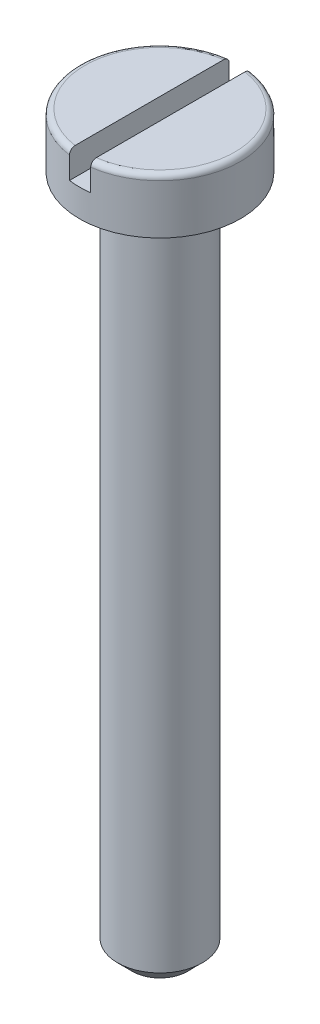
ISO-10303-21;
HEADER;
FILE_DESCRIPTION(('STEP AP214'),'2;1');
FILE_NAME('part.step','',(''),(''),'','','');
FILE_SCHEMA(('AUTOMOTIVE_DESIGN { 1 0 10303 214 1 1 1 1 }'));
ENDSEC;
DATA;
#1=APPLICATION_CONTEXT('core data for automotive mechanical design processes');
#2=APPLICATION_PROTOCOL_DEFINITION('international standard','automotive_design',2000,#1);
#3=PRODUCT_CONTEXT('',#1,'mechanical');
#4=PRODUCT('Part','Part','',(#3));
#5=PRODUCT_RELATED_PRODUCT_CATEGORY('part','',(#4));
#6=PRODUCT_DEFINITION_FORMATION('','',#4);
#7=PRODUCT_DEFINITION_CONTEXT('part definition',#1,'design');
#8=PRODUCT_DEFINITION('design','',#6,#7);
#9=PRODUCT_DEFINITION_SHAPE('','',#8);
#10=(LENGTH_UNIT() NAMED_UNIT(*) SI_UNIT(.MILLI.,.METRE.));
#11=(NAMED_UNIT(*) PLANE_ANGLE_UNIT() SI_UNIT($,.RADIAN.));
#12=(NAMED_UNIT(*) SI_UNIT($,.STERADIAN.) SOLID_ANGLE_UNIT());
#13=UNCERTAINTY_MEASURE_WITH_UNIT(LENGTH_MEASURE(1.E-05),#10,'distance_accuracy_value','');
#14=(GEOMETRIC_REPRESENTATION_CONTEXT(3) GLOBAL_UNCERTAINTY_ASSIGNED_CONTEXT((#13)) GLOBAL_UNIT_ASSIGNED_CONTEXT((#10,
#11,#12)) REPRESENTATION_CONTEXT('',''));
#15=CARTESIAN_POINT('',(0.,0.,0.));
#16=DIRECTION('',(0.,0.,1.));
#17=DIRECTION('',(1.,0.,0.));
#18=AXIS2_PLACEMENT_3D('',#15,#16,#17);
#19=CARTESIAN_POINT('',(0.,1.3,0.));
#20=DIRECTION('',(0.,-1.,0.));
#21=DIRECTION('',(0.,0.,-1.));
#22=AXIS2_PLACEMENT_3D('',#19,#20,#21);
#23=PLANE('',#22);
#24=CARTESIAN_POINT('',(0.,1.3,0.));
#25=DIRECTION('',(0.,1.,0.));
#26=DIRECTION('',(0.,0.,1.));
#27=AXIS2_PLACEMENT_3D('',#24,#25,#26);
#28=CIRCLE('',#27,1.77);
#29=CARTESIAN_POINT('',(-0.25,1.3,-1.75225568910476));
#30=VERTEX_POINT('',#29);
#31=CARTESIAN_POINT('',(-0.25,1.3,1.75225568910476));
#32=VERTEX_POINT('',#31);
#33=EDGE_CURVE('E96',#30,#32,#28,.T.);
#34=ORIENTED_EDGE('',*,*,#33,.T.);
#35=DIRECTION('',(0.,0.,1.));
#36=VECTOR('',#35,1.);
#37=CARTESIAN_POINT('',(-0.25,1.3,-1.9));
#38=LINE('',#37,#36);
#39=EDGE_CURVE('E87',#30,#32,#38,.T.);
#40=ORIENTED_EDGE('',*,*,#39,.F.);
#41=EDGE_LOOP('',(#34,#40));
#42=FACE_BOUND('',#41,.T.);
#43=ADVANCED_FACE('F33',(#42),#23,.F.);
#44=CARTESIAN_POINT('',(0.,1.17,0.));
#45=DIRECTION('',(0.,1.,0.));
#46=DIRECTION('',(0.,0.,1.));
#47=AXIS2_PLACEMENT_3D('',#44,#45,#46);
#48=TOROIDAL_SURFACE('',#47,1.77,0.13);
#49=ORIENTED_EDGE('',*,*,#33,.F.);
#50=CARTESIAN_POINT('',(-0.25,1.24765306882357,-1.85751121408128));
#51=CARTESIAN_POINT('',(-0.25,1.24184344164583,-1.8618768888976));
#52=CARTESIAN_POINT('',(-0.25,1.23566300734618,-1.8657574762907));
#53=CARTESIAN_POINT('',(-0.25,1.22273394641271,-1.87243030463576));
#54=CARTESIAN_POINT('',(-0.25,1.21598469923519,-1.87522133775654));
#55=CARTESIAN_POINT('',(-0.25,1.2021137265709,-1.8796278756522));
#56=CARTESIAN_POINT('',(-0.25,1.19499208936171,-1.88124365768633));
#57=CARTESIAN_POINT('',(-0.25,1.1805801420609,-1.88325159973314));
#58=CARTESIAN_POINT('',(-0.25,1.17328987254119,-1.88364405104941));
#59=CARTESIAN_POINT('',(-0.25,1.15877115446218,-1.88319529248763));
#60=CARTESIAN_POINT('',(-0.25,1.15154258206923,-1.88235808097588));
#61=CARTESIAN_POINT('',(-0.25,1.13732842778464,-1.87948214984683));
#62=CARTESIAN_POINT('',(-0.25,1.1303428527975,-1.87744339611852));
#63=CARTESIAN_POINT('',(-0.25,1.11681018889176,-1.87222403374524));
#64=CARTESIAN_POINT('',(-0.25,1.11026321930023,-1.86904311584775));
#65=CARTESIAN_POINT('',(-0.25,1.09779247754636,-1.86163282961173));
#66=CARTESIAN_POINT('',(-0.25,1.09186871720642,-1.85740344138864));
#67=CARTESIAN_POINT('',(-0.25,1.0807778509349,-1.84799363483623));
#68=CARTESIAN_POINT('',(-0.25,1.07561492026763,-1.84280829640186));
#69=CARTESIAN_POINT('',(-0.25,1.06622404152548,-1.83165084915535));
#70=CARTESIAN_POINT('',(-0.25,1.06199613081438,-1.82567870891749));
#71=CARTESIAN_POINT('',(-0.25,1.05455679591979,-1.81306325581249));
#72=CARTESIAN_POINT('',(-0.25,1.05135429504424,-1.80641468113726));
#73=CARTESIAN_POINT('',(-0.25,1.04610013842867,-1.79267739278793));
#74=CARTESIAN_POINT('',(-0.25,1.04404853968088,-1.78558865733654));
#75=CARTESIAN_POINT('',(-0.25,1.04113716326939,-1.77110723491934));
#76=CARTESIAN_POINT('',(-0.25,1.04028774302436,-1.76371246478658));
#77=CARTESIAN_POINT('',(-0.25,1.03983551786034,-1.74888481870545));
#78=CARTESIAN_POINT('',(-0.25,1.04023275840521,-1.74145194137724));
#79=CARTESIAN_POINT('',(-0.25,1.0422677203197,-1.72671918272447));
#80=CARTESIAN_POINT('',(-0.25,1.04391174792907,-1.71942017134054));
#81=CARTESIAN_POINT('',(-0.25,1.0484030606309,-1.70520204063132));
#82=CARTESIAN_POINT('',(-0.25,1.05125035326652,-1.69828292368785));
#83=CARTESIAN_POINT('',(-0.25,1.05806707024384,-1.68503083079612));
#84=CARTESIAN_POINT('',(-0.25,1.06203525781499,-1.67869721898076));
#85=CARTESIAN_POINT('',(-0.25,1.07098623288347,-1.66679261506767));
#86=CARTESIAN_POINT('',(-0.25,1.07596898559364,-1.66122159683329));
#87=CARTESIAN_POINT('',(-0.25,1.08676870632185,-1.65104713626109));
#88=CARTESIAN_POINT('',(-0.25,1.09257906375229,-1.64643667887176));
#89=CARTESIAN_POINT('',(-0.25,1.104898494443,-1.6382695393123));
#90=CARTESIAN_POINT('',(-0.25,1.11140752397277,-1.63471279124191));
#91=CARTESIAN_POINT('',(-0.25,1.12486287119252,-1.62879525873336));
#92=CARTESIAN_POINT('',(-0.25,1.13180360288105,-1.6264217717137));
#93=CARTESIAN_POINT('',(-0.25,1.14598688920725,-1.62288559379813));
#94=CARTESIAN_POINT('',(-0.25,1.15322942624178,-1.62172283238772));
#95=CARTESIAN_POINT('',(-0.25,1.1677414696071,-1.62064893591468));
#96=CARTESIAN_POINT('',(-0.25,1.17501015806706,-1.62072672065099));
#97=CARTESIAN_POINT('',(-0.25,1.18943061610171,-1.62210442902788));
#98=CARTESIAN_POINT('',(-0.25,1.19658238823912,-1.6234043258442));
#99=CARTESIAN_POINT('',(-0.25,1.21055111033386,-1.62718250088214));
#100=CARTESIAN_POINT('',(-0.25,1.2173687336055,-1.62965829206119));
#101=CARTESIAN_POINT('',(-0.25,1.23049498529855,-1.63571289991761));
#102=CARTESIAN_POINT('',(-0.25,1.23680360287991,-1.6392917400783));
#103=CARTESIAN_POINT('',(-0.25,1.24877339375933,-1.6474708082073));
#104=CARTESIAN_POINT('',(-0.25,1.25443060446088,-1.6520768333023));
#105=CARTESIAN_POINT('',(-0.25,1.26490155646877,-1.66216425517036));
#106=CARTESIAN_POINT('',(-0.25,1.2697152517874,-1.66764569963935));
#107=CARTESIAN_POINT('',(-0.25,1.27841666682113,-1.6793899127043));
#108=CARTESIAN_POINT('',(-0.25,1.28229410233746,-1.68566030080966));
#109=CARTESIAN_POINT('',(-0.25,1.28895337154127,-1.69875810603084));
#110=CARTESIAN_POINT('',(-0.25,1.29173514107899,-1.70558555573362));
#111=CARTESIAN_POINT('',(-0.25,1.29615144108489,-1.71967698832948));
#112=CARTESIAN_POINT('',(-0.25,1.29777424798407,-1.72694464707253));
#113=CARTESIAN_POINT('',(-0.25,1.29978331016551,-1.74164873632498));
#114=CARTESIAN_POINT('',(-0.25,1.30016956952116,-1.74908516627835));
#115=CARTESIAN_POINT('',(-0.25,1.29969333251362,-1.76395385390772));
#116=CARTESIAN_POINT('',(-0.25,1.29882483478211,-1.77138592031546));
#117=CARTESIAN_POINT('',(-0.25,1.29584988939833,-1.78600027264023));
#118=CARTESIAN_POINT('',(-0.25,1.29374313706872,-1.79318249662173));
#119=CARTESIAN_POINT('',(-0.25,1.28835198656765,-1.80707897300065));
#120=CARTESIAN_POINT('',(-0.25,1.2850691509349,-1.81379383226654));
#121=CARTESIAN_POINT('',(-0.25,1.27741685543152,-1.82656548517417));
#122=CARTESIAN_POINT('',(-0.25,1.27304873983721,-1.83262307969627));
#123=CARTESIAN_POINT('',(-0.25,1.26513647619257,-1.84182930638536));
#124=CARTESIAN_POINT('',(-0.25,1.2618794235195,-1.84522889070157));
#125=CARTESIAN_POINT('',(-0.25,1.25501770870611,-1.85165711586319));
#126=CARTESIAN_POINT('',(-0.25,1.25141304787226,-1.85468575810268));
#127=CARTESIAN_POINT('',(-0.25,1.24765306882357,-1.85751121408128));
#128=B_SPLINE_CURVE_WITH_KNOTS('',3,(#50,#51,#52,#53,#54,#55,#56,#57,#58,#59,#60,#61,#62,#63,
#64,#65,#66,#67,#68,#69,#70,#71,#72,#73,#74,#75,#76,#77,#78,#79,#80,#81,#82,#83,#84,#85,#86,#87,
#88,#89,#90,#91,#92,#93,#94,#95,#96,#97,#98,#99,#100,#101,#102,#103,#104,#105,#106,#107,#108,
#109,#110,#111,#112,#113,#114,#115,#116,#117,#118,#119,#120,#121,#122,#123,#124,#125,#126,#127),
.UNSPECIFIED.,.T.,.F.,(4,2,2,2,2,2,2,2,2,2,2,2,2,2,2,2,2,2,2,2,2,2,2,2,2,2,2,2,2,2,2,2,2,2,2,2,
2,2,4),(0.,0.0217843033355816,0.043592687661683,0.0653959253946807,0.0871939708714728,
0.10892129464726,0.130649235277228,0.152383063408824,0.174117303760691,0.1959666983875,
0.217816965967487,0.239852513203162,0.261889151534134,0.284114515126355,0.306340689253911,
0.328680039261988,0.351019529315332,0.373334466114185,0.395648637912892,0.417793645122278,
0.439937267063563,0.461837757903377,0.483736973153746,0.505440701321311,0.52714395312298,
0.548801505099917,0.570459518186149,0.592243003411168,0.614027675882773,0.636041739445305,
0.6580570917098,0.680292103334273,0.70252704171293,0.724868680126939,0.747215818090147,
0.769533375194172,0.791823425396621,0.805922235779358,0.820020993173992),.UNSPECIFIED.);
#129=CARTESIAN_POINT('',(-0.25,1.17,-1.88348082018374));
#130=VERTEX_POINT('',#129);
#131=EDGE_CURVE('E84',#30,#130,#128,.T.);
#132=ORIENTED_EDGE('',*,*,#131,.T.);
#133=CARTESIAN_POINT('',(0.,1.17,0.));
#134=DIRECTION('',(0.,1.,0.));
#135=DIRECTION('',(0.,0.,1.));
#136=AXIS2_PLACEMENT_3D('',#133,#134,#135);
#137=CIRCLE('',#136,1.9);
#138=CARTESIAN_POINT('',(-0.25,1.1700000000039,1.88348082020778));
#139=VERTEX_POINT('',#138);
#140=EDGE_CURVE('E103',#130,#139,#137,.T.);
#141=ORIENTED_EDGE('',*,*,#140,.T.);
#142=CARTESIAN_POINT('',(-0.25,1.22217563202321,1.63189133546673));
#143=CARTESIAN_POINT('',(-0.25,1.2155662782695,1.62896172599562));
#144=CARTESIAN_POINT('',(-0.25,1.20870599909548,1.62658586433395));
#145=CARTESIAN_POINT('',(-0.25,1.19467859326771,1.62301741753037));
#146=CARTESIAN_POINT('',(-0.25,1.18751113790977,1.62182613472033));
#147=CARTESIAN_POINT('',(-0.25,1.17307959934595,1.62066638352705));
#148=CARTESIAN_POINT('',(-0.25,1.1658155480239,1.62069752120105));
#149=CARTESIAN_POINT('',(-0.25,1.15139804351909,1.62198096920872));
#150=CARTESIAN_POINT('',(-0.25,1.14424456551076,1.62323300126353));
#151=CARTESIAN_POINT('',(-0.25,1.13025803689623,1.6269171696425));
#152=CARTESIAN_POINT('',(-0.25,1.12342459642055,1.62934782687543));
#153=CARTESIAN_POINT('',(-0.25,1.11025927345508,1.63531568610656));
#154=CARTESIAN_POINT('',(-0.25,1.10392741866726,1.63885294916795));
#155=CARTESIAN_POINT('',(-0.25,1.09190547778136,1.64695263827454));
#156=CARTESIAN_POINT('',(-0.25,1.08621921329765,1.65152073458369));
#157=CARTESIAN_POINT('',(-0.25,1.0756843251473,1.66153767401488));
#158=CARTESIAN_POINT('',(-0.25,1.07083574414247,1.66698656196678));
#159=CARTESIAN_POINT('',(-0.25,1.06205947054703,1.67867133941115));
#160=CARTESIAN_POINT('',(-0.25,1.05814197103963,1.68491488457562));
#161=CARTESIAN_POINT('',(-0.25,1.05139861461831,1.69796597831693));
#162=CARTESIAN_POINT('',(-0.25,1.04857281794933,1.70477355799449));
#163=CARTESIAN_POINT('',(-0.25,1.04406508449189,1.71883292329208));
#164=CARTESIAN_POINT('',(-0.25,1.04239489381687,1.72608847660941));
#165=CARTESIAN_POINT('',(-0.25,1.04028946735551,1.74077670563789));
#166=CARTESIAN_POINT('',(-0.25,1.03985427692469,1.74820938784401));
#167=CARTESIAN_POINT('',(-0.25,1.04023233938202,1.76308057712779));
#168=CARTESIAN_POINT('',(-0.25,1.04105188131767,1.77051892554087));
#169=CARTESIAN_POINT('',(-0.25,1.04393013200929,1.78515204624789));
#170=CARTESIAN_POINT('',(-0.25,1.04598884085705,1.7923468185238));
#171=CARTESIAN_POINT('',(-0.25,1.05128606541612,1.80627452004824));
#172=CARTESIAN_POINT('',(-0.25,1.0545226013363,1.81300820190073));
#173=CARTESIAN_POINT('',(-0.25,1.06208789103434,1.82583137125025));
#174=CARTESIAN_POINT('',(-0.25,1.06641660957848,1.83192087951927));
#175=CARTESIAN_POINT('',(-0.25,1.07601197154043,1.84323633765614));
#176=CARTESIAN_POINT('',(-0.25,1.081271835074,1.84846803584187));
#177=CARTESIAN_POINT('',(-0.25,1.09260224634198,1.85796431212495));
#178=CARTESIAN_POINT('',(-0.25,1.09867275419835,1.8622289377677));
#179=CARTESIAN_POINT('',(-0.25,1.1113932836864,1.86962939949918));
#180=CARTESIAN_POINT('',(-0.25,1.11803758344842,1.87277507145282));
#181=CARTESIAN_POINT('',(-0.25,1.1317626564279,1.87789675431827));
#182=CARTESIAN_POINT('',(-0.25,1.13884340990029,1.87987281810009));
#183=CARTESIAN_POINT('',(-0.25,1.15318400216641,1.88258559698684));
#184=CARTESIAN_POINT('',(-0.25,1.16044212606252,1.88333138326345));
#185=CARTESIAN_POINT('',(-0.25,1.17498019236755,1.8835896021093));
#186=CARTESIAN_POINT('',(-0.25,1.18226013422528,1.88310206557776));
#187=CARTESIAN_POINT('',(-0.25,1.19661137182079,1.88091174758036));
#188=CARTESIAN_POINT('',(-0.25,1.20368324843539,1.87921276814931));
#189=CARTESIAN_POINT('',(-0.25,1.21744230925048,1.87465415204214));
#190=CARTESIAN_POINT('',(-0.25,1.22412949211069,1.87179451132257));
#191=CARTESIAN_POINT('',(-0.25,1.23694611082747,1.86499113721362));
#192=CARTESIAN_POINT('',(-0.25,1.24307429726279,1.86104505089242));
#193=CARTESIAN_POINT('',(-0.25,1.25458685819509,1.85218647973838));
#194=CARTESIAN_POINT('',(-0.25,1.25997121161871,1.84727396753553));
#195=CARTESIAN_POINT('',(-0.25,1.26988286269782,1.83658758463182));
#196=CARTESIAN_POINT('',(-0.25,1.27440415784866,1.83080814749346));
#197=CARTESIAN_POINT('',(-0.25,1.28242241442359,1.81857781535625));
#198=CARTESIAN_POINT('',(-0.25,1.28591932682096,1.81212688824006));
#199=CARTESIAN_POINT('',(-0.25,1.29182246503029,1.79867523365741));
#200=CARTESIAN_POINT('',(-0.25,1.29421869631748,1.79167012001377));
#201=CARTESIAN_POINT('',(-0.25,1.29781120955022,1.77735865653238));
#202=CARTESIAN_POINT('',(-0.25,1.29900743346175,1.77005229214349));
#203=CARTESIAN_POINT('',(-0.25,1.30017372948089,1.75528528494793));
#204=CARTESIAN_POINT('',(-0.25,1.30013423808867,1.74782388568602));
#205=CARTESIAN_POINT('',(-0.25,1.29880740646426,1.73301302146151));
#206=CARTESIAN_POINT('',(-0.25,1.29752007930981,1.72566355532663));
#207=CARTESIAN_POINT('',(-0.25,1.29372696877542,1.71126230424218));
#208=CARTESIAN_POINT('',(-0.25,1.29121754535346,1.70421147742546));
#209=CARTESIAN_POINT('',(-0.25,1.28504573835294,1.69063136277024));
#210=CARTESIAN_POINT('',(-0.25,1.28138307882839,1.68410220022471));
#211=CARTESIAN_POINT('',(-0.25,1.27301908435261,1.67177695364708));
#212=CARTESIAN_POINT('',(-0.25,1.26832097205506,1.66597868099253));
#213=CARTESIAN_POINT('',(-0.25,1.25801286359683,1.65526810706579));
#214=CARTESIAN_POINT('',(-0.25,1.25240401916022,1.65035470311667));
#215=CARTESIAN_POINT('',(-0.25,1.24264953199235,1.64318421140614));
#216=CARTESIAN_POINT('',(-0.25,1.238728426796,1.64061623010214));
#217=CARTESIAN_POINT('',(-0.25,1.23063184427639,1.6359185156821));
#218=CARTESIAN_POINT('',(-0.25,1.2264563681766,1.63378878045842));
#219=CARTESIAN_POINT('',(-0.25,1.22217563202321,1.63189133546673));
#220=B_SPLINE_CURVE_WITH_KNOTS('',3,(#142,#143,#144,#145,#146,#147,#148,#149,#150,#151,#152,
#153,#154,#155,#156,#157,#158,#159,#160,#161,#162,#163,#164,#165,#166,#167,#168,#169,#170,#171,
#172,#173,#174,#175,#176,#177,#178,#179,#180,#181,#182,#183,#184,#185,#186,#187,#188,#189,#190,
#191,#192,#193,#194,#195,#196,#197,#198,#199,#200,#201,#202,#203,#204,#205,#206,#207,#208,#209,
#210,#211,#212,#213,#214,#215,#216,#217,#218,#219),.UNSPECIFIED.,.T.,.F.,(4,2,2,2,2,2,2,2,2,2,2,
2,2,2,2,2,2,2,2,2,2,2,2,2,2,2,2,2,2,2,2,2,2,2,2,2,2,2,4),(0.,0.0216716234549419,
0.043367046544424,0.0650554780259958,0.0867389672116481,0.108395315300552,0.130052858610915,
0.151832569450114,0.173613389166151,0.195622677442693,0.217633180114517,0.239864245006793,
0.262096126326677,0.284439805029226,0.306783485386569,0.329089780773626,0.351395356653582,
0.373544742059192,0.395693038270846,0.417641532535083,0.439589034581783,0.461373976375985,
0.483158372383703,0.50487469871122,0.526591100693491,0.5483549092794,0.570119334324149,
0.592030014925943,0.613941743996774,0.636048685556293,0.658156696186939,0.680435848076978,
0.702714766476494,0.725060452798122,0.747411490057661,0.769693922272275,0.791948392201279,
0.805984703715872,0.820020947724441),.UNSPECIFIED.);
#221=EDGE_CURVE('E93',#139,#32,#220,.T.);
#222=ORIENTED_EDGE('',*,*,#221,.T.);
#223=EDGE_LOOP('',(#49,#132,#141,#222));
#224=FACE_BOUND('',#223,.T.);
#225=ADVANCED_FACE('F99',(#224),#48,.T.);
#226=CARTESIAN_POINT('',(0.,-16.,0.));
#227=DIRECTION('',(0.,1.,0.));
#228=DIRECTION('',(0.,0.,1.));
#229=AXIS2_PLACEMENT_3D('',#226,#227,#228);
#230=CYLINDRICAL_SURFACE('',#229,1.);
#231=CARTESIAN_POINT('',(0.,-15.65,0.));
#232=DIRECTION('',(0.,1.,0.));
#233=DIRECTION('',(0.,0.,1.));
#234=AXIS2_PLACEMENT_3D('',#231,#232,#233);
#235=CIRCLE('',#234,1.);
#236=CARTESIAN_POINT('',(0.,-15.65,1.));
#237=VERTEX_POINT('',#236);
#238=EDGE_CURVE('E116',#237,#237,#235,.T.);
#239=ORIENTED_EDGE('',*,*,#238,.T.);
#240=EDGE_LOOP('',(#239));
#241=FACE_BOUND('',#240,.T.);
#242=CARTESIAN_POINT('',(0.,0.,0.));
#243=DIRECTION('',(0.,1.,0.));
#244=DIRECTION('',(0.,0.,1.));
#245=AXIS2_PLACEMENT_3D('',#242,#243,#244);
#246=CIRCLE('',#245,1.);
#247=CARTESIAN_POINT('',(0.,0.,1.));
#248=VERTEX_POINT('',#247);
#249=EDGE_CURVE('E113',#248,#248,#246,.T.);
#250=ORIENTED_EDGE('',*,*,#249,.F.);
#251=EDGE_LOOP('',(#250));
#252=FACE_BOUND('',#251,.T.);
#253=ADVANCED_FACE('F184',(#241,#252),#230,.T.);
#254=CARTESIAN_POINT('',(0.,-16.,0.));
#255=DIRECTION('',(0.,1.,0.));
#256=DIRECTION('',(0.,0.,1.));
#257=AXIS2_PLACEMENT_3D('',#254,#255,#256);
#258=PLANE('',#257);
#259=CARTESIAN_POINT('',(0.,-16.,0.));
#260=DIRECTION('',(0.,1.,0.));
#261=DIRECTION('',(0.,0.,1.));
#262=AXIS2_PLACEMENT_3D('',#259,#260,#261);
#263=CIRCLE('',#262,0.649999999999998);
#264=CARTESIAN_POINT('',(0.,-16.,0.649999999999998));
#265=VERTEX_POINT('',#264);
#266=EDGE_CURVE('E119',#265,#265,#263,.F.);
#267=ORIENTED_EDGE('',*,*,#266,.T.);
#268=EDGE_LOOP('',(#267));
#269=FACE_BOUND('',#268,.T.);
#270=ADVANCED_FACE('F194',(#269),#258,.F.);
#271=CARTESIAN_POINT('',(0.,-15.65,0.));
#272=DIRECTION('',(0.,1.,0.));
#273=DIRECTION('',(0.,0.,1.));
#274=AXIS2_PLACEMENT_3D('',#271,#272,#273);
#275=CONICAL_SURFACE('',#274,1.,0.785398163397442);
#276=ORIENTED_EDGE('',*,*,#266,.F.);
#277=EDGE_LOOP('',(#276));
#278=FACE_BOUND('',#277,.T.);
#279=ORIENTED_EDGE('',*,*,#238,.F.);
#280=EDGE_LOOP('',(#279));
#281=FACE_BOUND('',#280,.T.);
#282=ADVANCED_FACE('F35',(#278,#281),#275,.T.);
#283=CARTESIAN_POINT('',(0.25,1.3,1.75225568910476));
#284=VERTEX_POINT('',#283);
#285=CARTESIAN_POINT('',(0.25,1.3,-1.75225568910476));
#286=VERTEX_POINT('',#285);
#287=EDGE_CURVE('E100',#284,#286,#28,.T.);
#288=ORIENTED_EDGE('',*,*,#287,.T.);
#289=DIRECTION('',(0.,0.,-1.));
#290=VECTOR('',#289,1.);
#291=CARTESIAN_POINT('',(0.25,1.3,-1.9));
#292=LINE('',#291,#290);
#293=EDGE_CURVE('E97',#284,#286,#292,.T.);
#294=ORIENTED_EDGE('',*,*,#293,.F.);
#295=EDGE_LOOP('',(#288,#294));
#296=FACE_BOUND('',#295,.T.);
#297=ADVANCED_FACE('F158',(#296),#23,.F.);
#298=CARTESIAN_POINT('',(0.,0.,0.));
#299=DIRECTION('',(0.,1.,0.));
#300=DIRECTION('',(0.,0.,1.));
#301=AXIS2_PLACEMENT_3D('',#298,#299,#300);
#302=PLANE('',#301);
#303=ORIENTED_EDGE('',*,*,#249,.T.);
#304=EDGE_LOOP('',(#303));
#305=FACE_BOUND('',#304,.T.);
#306=CARTESIAN_POINT('',(0.,0.,0.));
#307=DIRECTION('',(0.,1.,0.));
#308=DIRECTION('',(0.,0.,1.));
#309=AXIS2_PLACEMENT_3D('',#306,#307,#308);
#310=CIRCLE('',#309,1.9);
#311=CARTESIAN_POINT('',(0.,0.,1.9));
#312=VERTEX_POINT('',#311);
#313=EDGE_CURVE('E110',#312,#312,#310,.T.);
#314=ORIENTED_EDGE('',*,*,#313,.F.);
#315=EDGE_LOOP('',(#314));
#316=FACE_BOUND('',#315,.T.);
#317=ADVANCED_FACE('F188',(#305,#316),#302,.F.);
#318=CARTESIAN_POINT('',(0.,1.3,0.));
#319=DIRECTION('',(0.,1.,0.));
#320=DIRECTION('',(0.,0.,1.));
#321=AXIS2_PLACEMENT_3D('',#318,#319,#320);
#322=CYLINDRICAL_SURFACE('',#321,1.9);
#323=ORIENTED_EDGE('',*,*,#140,.F.);
#324=DIRECTION('',(0.,1.,0.));
#325=VECTOR('',#324,1.);
#326=CARTESIAN_POINT('',(-0.25,1.3,-1.88348082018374));
#327=LINE('',#326,#325);
#328=CARTESIAN_POINT('',(-0.25,0.65,-1.88348082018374));
#329=VERTEX_POINT('',#328);
#330=EDGE_CURVE('E56',#130,#329,#327,.F.);
#331=ORIENTED_EDGE('',*,*,#330,.T.);
#332=CARTESIAN_POINT('',(0.,0.65,0.));
#333=DIRECTION('',(0.,1.,0.));
#334=DIRECTION('',(0.,0.,1.));
#335=AXIS2_PLACEMENT_3D('',#332,#333,#334);
#336=CIRCLE('',#335,1.9);
#337=CARTESIAN_POINT('',(0.25,0.65,-1.88348082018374));
#338=VERTEX_POINT('',#337);
#339=EDGE_CURVE('E11',#338,#329,#336,.T.);
#340=ORIENTED_EDGE('',*,*,#339,.F.);
#341=DIRECTION('',(0.,1.,0.));
#342=VECTOR('',#341,1.);
#343=CARTESIAN_POINT('',(0.25,1.3,-1.88348082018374));
#344=LINE('',#343,#342);
#345=CARTESIAN_POINT('',(0.25,1.17000000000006,-1.88348082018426));
#346=VERTEX_POINT('',#345);
#347=EDGE_CURVE('E167',#338,#346,#344,.T.);
#348=ORIENTED_EDGE('',*,*,#347,.T.);
#349=CARTESIAN_POINT('',(0.25,1.17,1.88348082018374));
#350=VERTEX_POINT('',#349);
#351=EDGE_CURVE('E109',#350,#346,#137,.T.);
#352=ORIENTED_EDGE('',*,*,#351,.F.);
#353=DIRECTION('',(0.,1.,0.));
#354=VECTOR('',#353,1.);
#355=CARTESIAN_POINT('',(0.25,1.3,1.88348082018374));
#356=LINE('',#355,#354);
#357=CARTESIAN_POINT('',(0.25,0.65,1.88348082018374));
#358=VERTEX_POINT('',#357);
#359=EDGE_CURVE('E48',#350,#358,#356,.F.);
#360=ORIENTED_EDGE('',*,*,#359,.T.);
#361=CARTESIAN_POINT('',(-0.25,0.65,1.88348082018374));
#362=VERTEX_POINT('',#361);
#363=EDGE_CURVE('E37',#362,#358,#336,.T.);
#364=ORIENTED_EDGE('',*,*,#363,.F.);
#365=DIRECTION('',(0.,1.,0.));
#366=VECTOR('',#365,1.);
#367=CARTESIAN_POINT('',(-0.25,1.3,1.88348082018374));
#368=LINE('',#367,#366);
#369=EDGE_CURVE('E104',#362,#139,#368,.T.);
#370=ORIENTED_EDGE('',*,*,#369,.T.);
#371=EDGE_LOOP('',(#323,#331,#340,#348,#352,#360,#364,#370));
#372=FACE_BOUND('',#371,.T.);
#373=ORIENTED_EDGE('',*,*,#313,.T.);
#374=EDGE_LOOP('',(#373));
#375=FACE_BOUND('',#374,.T.);
#376=ADVANCED_FACE('F171',(#372,#375),#322,.T.);
#377=ORIENTED_EDGE('',*,*,#351,.T.);
#378=CARTESIAN_POINT('',(0.25,1.24765306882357,-1.85751121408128));
#379=CARTESIAN_POINT('',(0.25,1.2535323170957,-1.85309239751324));
#380=CARTESIAN_POINT('',(0.25,1.25904032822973,-1.84817022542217));
#381=CARTESIAN_POINT('',(0.25,1.2691540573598,-1.8374648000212));
#382=CARTESIAN_POINT('',(0.25,1.27375858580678,-1.83168042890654));
#383=CARTESIAN_POINT('',(0.25,1.28192985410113,-1.81942676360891));
#384=CARTESIAN_POINT('',(0.25,1.28549748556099,-1.81295806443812));
#385=CARTESIAN_POINT('',(0.25,1.29150306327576,-1.79951842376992));
#386=CARTESIAN_POINT('',(0.25,1.29394128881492,-1.79254760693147));
#387=CARTESIAN_POINT('',(0.25,1.29763786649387,-1.77825097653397));
#388=CARTESIAN_POINT('',(0.25,1.29888837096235,-1.77092313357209));
#389=CARTESIAN_POINT('',(0.25,1.3001493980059,-1.75616113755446));
#390=CARTESIAN_POINT('',(0.25,1.30015981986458,-1.74872697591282));
#391=CARTESIAN_POINT('',(0.25,1.29893752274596,-1.73391737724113));
#392=CARTESIAN_POINT('',(0.25,1.2976974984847,-1.72654254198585));
#393=CARTESIAN_POINT('',(0.25,1.29399712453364,-1.71210548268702));
#394=CARTESIAN_POINT('',(0.25,1.29153676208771,-1.70504326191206));
#395=CARTESIAN_POINT('',(0.25,1.28546235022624,-1.69143332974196));
#396=CARTESIAN_POINT('',(0.25,1.2818482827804,-1.68488562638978));
#397=CARTESIAN_POINT('',(0.25,1.27356523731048,-1.67249520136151));
#398=CARTESIAN_POINT('',(0.25,1.2688962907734,-1.66665245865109));
#399=CARTESIAN_POINT('',(0.25,1.25866740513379,-1.65588110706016));
#400=CARTESIAN_POINT('',(0.25,1.25311359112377,-1.65094668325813));
#401=CARTESIAN_POINT('',(0.25,1.24124864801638,-1.64209244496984));
#402=CARTESIAN_POINT('',(0.25,1.23493756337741,-1.63817257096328));
#403=CARTESIAN_POINT('',(0.25,1.221809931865,-1.63150376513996));
#404=CARTESIAN_POINT('',(0.25,1.21499955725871,-1.62874268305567));
#405=CARTESIAN_POINT('',(0.25,1.20100918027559,-1.62441574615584));
#406=CARTESIAN_POINT('',(0.25,1.19382920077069,-1.62284981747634));
#407=CARTESIAN_POINT('',(0.25,1.17937779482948,-1.62097087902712));
#408=CARTESIAN_POINT('',(0.25,1.17210791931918,-1.62064592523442));
#409=CARTESIAN_POINT('',(0.25,1.15761752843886,-1.62122580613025));
#410=CARTESIAN_POINT('',(0.25,1.15039701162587,-1.62213060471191));
#411=CARTESIAN_POINT('',(0.25,1.13623565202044,-1.62513698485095));
#412=CARTESIAN_POINT('',(0.25,1.12929393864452,-1.62723447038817));
#413=CARTESIAN_POINT('',(0.25,1.11585878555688,-1.63255985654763));
#414=CARTESIAN_POINT('',(0.25,1.10936535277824,-1.63578777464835));
#415=CARTESIAN_POINT('',(0.25,1.0969773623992,-1.64329576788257));
#416=CARTESIAN_POINT('',(0.25,1.09108571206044,-1.64758063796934));
#417=CARTESIAN_POINT('',(0.25,1.0800962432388,-1.65706952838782));
#418=CARTESIAN_POINT('',(0.25,1.07499846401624,-1.66227359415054));
#419=CARTESIAN_POINT('',(0.25,1.06568607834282,-1.67350893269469));
#420=CARTESIAN_POINT('',(0.25,1.06148091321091,-1.67954803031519));
#421=CARTESIAN_POINT('',(0.25,1.05413182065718,-1.69224064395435));
#422=CARTESIAN_POINT('',(0.25,1.05098795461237,-1.69889419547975));
#423=CARTESIAN_POINT('',(0.25,1.04581768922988,-1.71270143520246));
#424=CARTESIAN_POINT('',(0.25,1.0438032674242,-1.71985961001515));
#425=CARTESIAN_POINT('',(0.25,1.04099678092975,-1.7344117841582));
#426=CARTESIAN_POINT('',(0.25,1.04020476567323,-1.74180579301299));
#427=CARTESIAN_POINT('',(0.25,1.03986397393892,-1.75666650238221));
#428=CARTESIAN_POINT('',(0.25,1.0403225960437,-1.76413337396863));
#429=CARTESIAN_POINT('',(0.25,1.04248769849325,-1.7788841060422));
#430=CARTESIAN_POINT('',(0.25,1.04419418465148,-1.78616796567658));
#431=CARTESIAN_POINT('',(0.25,1.04880820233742,-1.80033913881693));
#432=CARTESIAN_POINT('',(0.25,1.05171485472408,-1.8072267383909));
#433=CARTESIAN_POINT('',(0.25,1.05865047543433,-1.82041177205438));
#434=CARTESIAN_POINT('',(0.25,1.06267941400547,-1.8267092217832));
#435=CARTESIAN_POINT('',(0.25,1.07171885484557,-1.83849095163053));
#436=CARTESIAN_POINT('',(0.25,1.07672289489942,-1.8439801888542));
#437=CARTESIAN_POINT('',(0.25,1.08758896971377,-1.85403127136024));
#438=CARTESIAN_POINT('',(0.25,1.0934509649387,-1.85859315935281));
#439=CARTESIAN_POINT('',(0.25,1.10581028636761,-1.86661667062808));
#440=CARTESIAN_POINT('',(0.25,1.11230146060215,-1.87008777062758));
#441=CARTESIAN_POINT('',(0.25,1.12577749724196,-1.87588085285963));
#442=CARTESIAN_POINT('',(0.25,1.13276231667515,-1.87820293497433));
#443=CARTESIAN_POINT('',(0.25,1.14696788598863,-1.88161455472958));
#444=CARTESIAN_POINT('',(0.25,1.15418632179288,-1.88271373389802));
#445=CARTESIAN_POINT('',(0.25,1.16870712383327,-1.88367959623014));
#446=CARTESIAN_POINT('',(0.25,1.17600950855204,-1.88354600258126));
#447=CARTESIAN_POINT('',(0.25,1.19046209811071,-1.88205268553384));
#448=CARTESIAN_POINT('',(0.25,1.19761273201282,-1.88069708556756));
#449=CARTESIAN_POINT('',(0.25,1.21157896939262,-1.87680635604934));
#450=CARTESIAN_POINT('',(0.25,1.21839497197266,-1.87427267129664));
#451=CARTESIAN_POINT('',(0.25,1.22895271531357,-1.8693056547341));
#452=CARTESIAN_POINT('',(0.25,1.23285989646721,-1.86721588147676));
#453=CARTESIAN_POINT('',(0.25,1.24044057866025,-1.86264860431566));
#454=CARTESIAN_POINT('',(0.25,1.24411408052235,-1.86017110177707));
#455=CARTESIAN_POINT('',(0.25,1.24765306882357,-1.85751121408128));
#456=B_SPLINE_CURVE_WITH_KNOTS('',3,(#378,#379,#380,#381,#382,#383,#384,#385,#386,#387,#388,
#389,#390,#391,#392,#393,#394,#395,#396,#397,#398,#399,#400,#401,#402,#403,#404,#405,#406,#407,
#408,#409,#410,#411,#412,#413,#414,#415,#416,#417,#418,#419,#420,#421,#422,#423,#424,#425,#426,
#427,#428,#429,#430,#431,#432,#433,#434,#435,#436,#437,#438,#439,#440,#441,#442,#443,#444,#445,
#446,#447,#448,#449,#450,#451,#452,#453,#454,#455),.UNSPECIFIED.,.T.,.F.,(4,2,2,2,2,2,2,2,2,2,2,
2,2,2,2,2,2,2,2,2,2,2,2,2,2,2,2,2,2,2,2,2,2,2,2,2,2,2,4),(0.,0.0220477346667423,
0.0441243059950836,0.0661818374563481,0.0882339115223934,0.110430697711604,0.132629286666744,
0.15495831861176,0.177287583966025,0.199617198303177,0.221946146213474,0.244126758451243,
0.266306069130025,0.288246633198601,0.310185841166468,0.331913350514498,0.353640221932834,
0.375292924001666,0.396945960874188,0.418699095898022,0.440453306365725,0.462427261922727,
0.484402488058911,0.50660655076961,0.528811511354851,0.551148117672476,0.573484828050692,
0.595805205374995,0.618124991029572,0.640301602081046,0.66247719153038,0.684454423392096,
0.706429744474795,0.728230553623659,0.75003625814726,0.771768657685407,0.793474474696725,
0.806746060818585,0.82001760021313),.UNSPECIFIED.);
#457=EDGE_CURVE('E128',#346,#286,#456,.T.);
#458=ORIENTED_EDGE('',*,*,#457,.T.);
#459=ORIENTED_EDGE('',*,*,#287,.F.);
#460=CARTESIAN_POINT('',(0.25,1.22217563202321,1.63189133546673));
#461=CARTESIAN_POINT('',(0.25,1.22886767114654,1.63485832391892));
#462=CARTESIAN_POINT('',(0.25,1.23531223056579,1.6383974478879));
#463=CARTESIAN_POINT('',(0.25,1.24751873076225,1.64651362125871));
#464=CARTESIAN_POINT('',(0.25,1.25327976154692,1.65109203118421));
#465=CARTESIAN_POINT('',(0.25,1.26394861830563,1.66114473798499));
#466=CARTESIAN_POINT('',(0.25,1.26885724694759,1.666618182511));
#467=CARTESIAN_POINT('',(0.25,1.27769326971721,1.67830402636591));
#468=CARTESIAN_POINT('',(0.25,1.28162090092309,1.68451624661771));
#469=CARTESIAN_POINT('',(0.25,1.28842015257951,1.69755830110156));
#470=CARTESIAN_POINT('',(0.25,1.29128294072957,1.70439274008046));
#471=CARTESIAN_POINT('',(0.25,1.29583101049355,1.7184431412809));
#472=CARTESIAN_POINT('',(0.25,1.2975161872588,1.72565913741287));
#473=CARTESIAN_POINT('',(0.25,1.29967231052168,1.74032942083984));
#474=CARTESIAN_POINT('',(0.25,1.30013344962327,1.74778515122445));
#475=CARTESIAN_POINT('',(0.25,1.29979998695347,1.76266860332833));
#476=CARTESIAN_POINT('',(0.25,1.29900536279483,1.7700963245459));
#477=CARTESIAN_POINT('',(0.25,1.29617810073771,1.78472604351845));
#478=CARTESIAN_POINT('',(0.25,1.29414329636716,1.79192762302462));
#479=CARTESIAN_POINT('',(0.25,1.28888801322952,1.80588449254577));
#480=CARTESIAN_POINT('',(0.25,1.28566755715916,1.81263979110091));
#481=CARTESIAN_POINT('',(0.25,1.27814634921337,1.82547779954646));
#482=CARTESIAN_POINT('',(0.25,1.27385065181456,1.83156346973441));
#483=CARTESIAN_POINT('',(0.25,1.264290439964,1.84291937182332));
#484=CARTESIAN_POINT('',(0.25,1.2590259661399,1.84818963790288));
#485=CARTESIAN_POINT('',(0.25,1.24772506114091,1.85771712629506));
#486=CARTESIAN_POINT('',(0.25,1.24169554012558,1.86198254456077));
#487=CARTESIAN_POINT('',(0.25,1.22900094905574,1.86943016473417));
#488=CARTESIAN_POINT('',(0.25,1.22233591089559,1.87261242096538));
#489=CARTESIAN_POINT('',(0.25,1.20862156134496,1.87777530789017));
#490=CARTESIAN_POINT('',(0.25,1.2015760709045,1.87976609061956));
#491=CARTESIAN_POINT('',(0.25,1.1872501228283,1.88252916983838));
#492=CARTESIAN_POINT('',(0.25,1.17996967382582,1.88330151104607));
#493=CARTESIAN_POINT('',(0.25,1.16542361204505,1.88360369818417));
#494=CARTESIAN_POINT('',(0.25,1.15815814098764,1.88314041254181));
#495=CARTESIAN_POINT('',(0.25,1.14380841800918,1.88099982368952));
#496=CARTESIAN_POINT('',(0.25,1.13672416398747,1.87932253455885));
#497=CARTESIAN_POINT('',(0.25,1.12294112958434,1.87480499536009));
#498=CARTESIAN_POINT('',(0.25,1.11624214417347,1.87196537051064));
#499=CARTESIAN_POINT('',(0.25,1.10341298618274,1.86520673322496));
#500=CARTESIAN_POINT('',(0.25,1.0972828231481,1.86128770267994));
#501=CARTESIAN_POINT('',(0.25,1.08573392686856,1.85246369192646));
#502=CARTESIAN_POINT('',(0.25,1.08031860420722,1.84755424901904));
#503=CARTESIAN_POINT('',(0.25,1.07038087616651,1.83690248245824));
#504=CARTESIAN_POINT('',(0.25,1.06585850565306,1.83116012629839));
#505=CARTESIAN_POINT('',(0.25,1.05779517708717,1.81895574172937));
#506=CARTESIAN_POINT('',(0.25,1.05426253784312,1.81248821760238));
#507=CARTESIAN_POINT('',(0.25,1.04832234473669,1.79905568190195));
#508=CARTESIAN_POINT('',(0.25,1.04591484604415,1.79209064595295));
#509=CARTESIAN_POINT('',(0.25,1.04227191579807,1.77779524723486));
#510=CARTESIAN_POINT('',(0.25,1.04104696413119,1.77046221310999));
#511=CARTESIAN_POINT('',(0.25,1.03983767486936,1.75569449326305));
#512=CARTESIAN_POINT('',(0.25,1.03985338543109,1.74825980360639));
#513=CARTESIAN_POINT('',(0.25,1.04112789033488,1.73345382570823));
#514=CARTESIAN_POINT('',(0.25,1.04239393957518,1.72608316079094));
#515=CARTESIAN_POINT('',(0.25,1.0461453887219,1.7116587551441));
#516=CARTESIAN_POINT('',(0.25,1.04863080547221,1.70460501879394));
#517=CARTESIAN_POINT('',(0.25,1.05475343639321,1.69101672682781));
#518=CARTESIAN_POINT('',(0.25,1.05839058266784,1.68448214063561));
#519=CARTESIAN_POINT('',(0.25,1.06671731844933,1.67212169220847));
#520=CARTESIAN_POINT('',(0.25,1.07140688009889,1.6662958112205));
#521=CARTESIAN_POINT('',(0.25,1.08167354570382,1.65556163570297));
#522=CARTESIAN_POINT('',(0.25,1.08724450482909,1.65064746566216));
#523=CARTESIAN_POINT('',(0.25,1.09913984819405,1.64183658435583));
#524=CARTESIAN_POINT('',(0.25,1.10546415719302,1.63793977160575));
#525=CARTESIAN_POINT('',(0.25,1.11861309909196,1.63131912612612));
#526=CARTESIAN_POINT('',(0.25,1.12543153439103,1.62858298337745));
#527=CARTESIAN_POINT('',(0.25,1.13943562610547,1.6243062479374));
#528=CARTESIAN_POINT('',(0.25,1.14662135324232,1.62276588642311));
#529=CARTESIAN_POINT('',(0.25,1.16108288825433,1.62093773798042));
#530=CARTESIAN_POINT('',(0.25,1.16835727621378,1.62063865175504));
#531=CARTESIAN_POINT('',(0.25,1.18284597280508,1.62127192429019));
#532=CARTESIAN_POINT('',(0.25,1.1900603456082,1.6222027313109));
#533=CARTESIAN_POINT('',(0.25,1.20143847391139,1.62465969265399));
#534=CARTESIAN_POINT('',(0.25,1.2056873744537,1.62580836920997));
#535=CARTESIAN_POINT('',(0.25,1.21404583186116,1.62853298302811));
#536=CARTESIAN_POINT('',(0.25,1.21815538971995,1.63010891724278));
#537=CARTESIAN_POINT('',(0.25,1.22217563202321,1.63189133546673));
#538=B_SPLINE_CURVE_WITH_KNOTS('',3,(#460,#461,#462,#463,#464,#465,#466,#467,#468,#469,#470,
#471,#472,#473,#474,#475,#476,#477,#478,#479,#480,#481,#482,#483,#484,#485,#486,#487,#488,#489,
#490,#491,#492,#493,#494,#495,#496,#497,#498,#499,#500,#501,#502,#503,#504,#505,#506,#507,#508,
#509,#510,#511,#512,#513,#514,#515,#516,#517,#518,#519,#520,#521,#522,#523,#524,#525,#526,#527,
#528,#529,#530,#531,#532,#533,#534,#535,#536,#537),.UNSPECIFIED.,.T.,.F.,(4,2,2,2,2,2,2,2,2,2,2,
2,2,2,2,2,2,2,2,2,2,2,2,2,2,2,2,2,2,2,2,2,2,2,2,2,2,2,4),(0.,0.0219445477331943,
0.0439179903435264,0.0658706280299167,0.0878179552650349,0.109943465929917,0.132070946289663,
0.154375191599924,0.176679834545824,0.199023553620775,0.221366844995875,0.243607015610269,
0.265846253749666,0.287897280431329,0.309947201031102,0.331806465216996,0.353664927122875,
0.375402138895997,0.397139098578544,0.418864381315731,0.44059002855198,0.462415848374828,
0.484242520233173,0.506247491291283,0.528253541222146,0.550452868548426,0.572653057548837,
0.594982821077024,0.617312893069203,0.639641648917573,0.661969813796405,0.684148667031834,
0.706325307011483,0.728260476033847,0.750199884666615,0.771939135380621,0.793650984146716,
0.806834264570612,0.820017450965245),.UNSPECIFIED.);
#539=EDGE_CURVE('E122',#284,#350,#538,.T.);
#540=ORIENTED_EDGE('',*,*,#539,.T.);
#541=EDGE_LOOP('',(#377,#458,#459,#540));
#542=FACE_BOUND('',#541,.T.);
#543=ADVANCED_FACE('F132',(#542),#48,.T.);
#544=CARTESIAN_POINT('',(-0.25,0.65,1.9));
#545=DIRECTION('',(0.,1.,0.));
#546=DIRECTION('',(0.,0.,1.));
#547=AXIS2_PLACEMENT_3D('',#544,#545,#546);
#548=PLANE('',#547);
#549=DIRECTION('',(0.,0.,-1.));
#550=VECTOR('',#549,1.);
#551=CARTESIAN_POINT('',(0.25,0.65,-1.9));
#552=LINE('',#551,#550);
#553=EDGE_CURVE('E162',#358,#338,#552,.T.);
#554=ORIENTED_EDGE('',*,*,#553,.T.);
#555=ORIENTED_EDGE('',*,*,#339,.T.);
#556=DIRECTION('',(0.,0.,1.));
#557=VECTOR('',#556,1.);
#558=CARTESIAN_POINT('',(-0.25,0.65,-1.9));
#559=LINE('',#558,#557);
#560=EDGE_CURVE('E159',#329,#362,#559,.T.);
#561=ORIENTED_EDGE('',*,*,#560,.T.);
#562=ORIENTED_EDGE('',*,*,#363,.T.);
#563=EDGE_LOOP('',(#554,#555,#561,#562));
#564=FACE_BOUND('',#563,.T.);
#565=ADVANCED_FACE('F140',(#564),#548,.T.);
#566=CARTESIAN_POINT('',(-0.25,0.65,-1.9));
#567=DIRECTION('',(-1.,0.,0.));
#568=DIRECTION('',(0.,0.,1.));
#569=AXIS2_PLACEMENT_3D('',#566,#567,#568);
#570=PLANE('',#569);
#571=ORIENTED_EDGE('',*,*,#131,.F.);
#572=ORIENTED_EDGE('',*,*,#39,.T.);
#573=ORIENTED_EDGE('',*,*,#221,.F.);
#574=ORIENTED_EDGE('',*,*,#369,.F.);
#575=ORIENTED_EDGE('',*,*,#560,.F.);
#576=ORIENTED_EDGE('',*,*,#330,.F.);
#577=EDGE_LOOP('',(#571,#572,#573,#574,#575,#576));
#578=FACE_BOUND('',#577,.T.);
#579=ADVANCED_FACE('F86',(#578),#570,.F.);
#580=CARTESIAN_POINT('',(0.25,0.65,-1.9));
#581=DIRECTION('',(1.,0.,0.));
#582=DIRECTION('',(0.,0.,-1.));
#583=AXIS2_PLACEMENT_3D('',#580,#581,#582);
#584=PLANE('',#583);
#585=ORIENTED_EDGE('',*,*,#553,.F.);
#586=ORIENTED_EDGE('',*,*,#359,.F.);
#587=ORIENTED_EDGE('',*,*,#539,.F.);
#588=ORIENTED_EDGE('',*,*,#293,.T.);
#589=ORIENTED_EDGE('',*,*,#457,.F.);
#590=ORIENTED_EDGE('',*,*,#347,.F.);
#591=EDGE_LOOP('',(#585,#586,#587,#588,#589,#590));
#592=FACE_BOUND('',#591,.T.);
#593=ADVANCED_FACE('F136',(#592),#584,.F.);
#594=CLOSED_SHELL('',(#43,#225,#253,#270,#282,#297,#317,#376,#543,#565,#579,#593));
#595=MANIFOLD_SOLID_BREP('B2',#594);
#596=ADVANCED_BREP_SHAPE_REPRESENTATION('',(#18,#595),#14);
#597=SHAPE_DEFINITION_REPRESENTATION(#9,#596);
ENDSEC;
END-ISO-10303-21;
